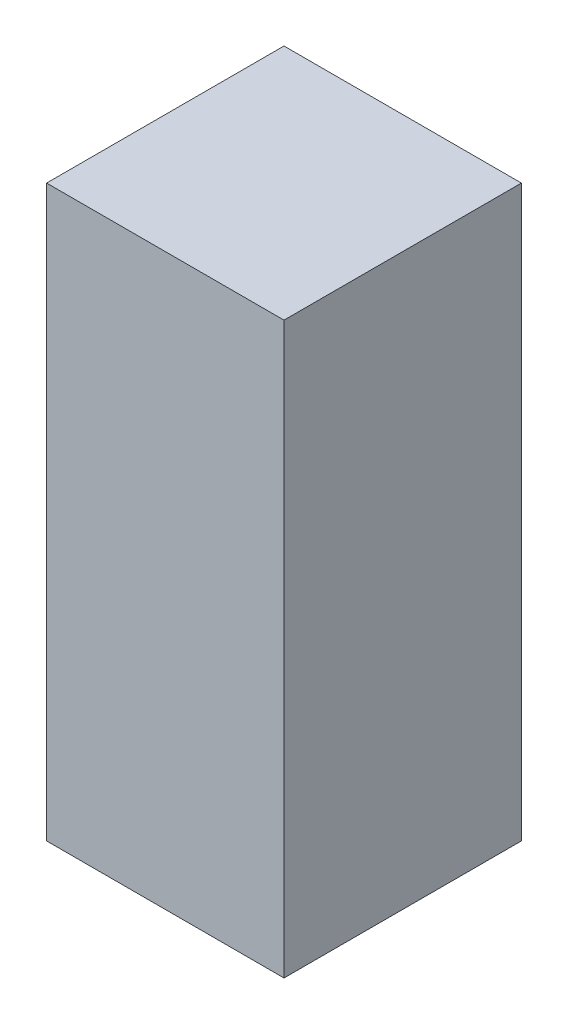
ISO-10303-21;
HEADER;
FILE_DESCRIPTION(('STEP AP214'),'2;1');
FILE_NAME('part.step','',(''),(''),'','','');
FILE_SCHEMA(('AUTOMOTIVE_DESIGN { 1 0 10303 214 1 1 1 1 }'));
ENDSEC;
DATA;
#1=APPLICATION_CONTEXT('core data for automotive mechanical design processes');
#2=APPLICATION_PROTOCOL_DEFINITION('international standard','automotive_design',2000,#1);
#3=PRODUCT_CONTEXT('',#1,'mechanical');
#4=PRODUCT('Part','Part','',(#3));
#5=PRODUCT_RELATED_PRODUCT_CATEGORY('part','',(#4));
#6=PRODUCT_DEFINITION_FORMATION('','',#4);
#7=PRODUCT_DEFINITION_CONTEXT('part definition',#1,'design');
#8=PRODUCT_DEFINITION('design','',#6,#7);
#9=PRODUCT_DEFINITION_SHAPE('','',#8);
#10=(LENGTH_UNIT() NAMED_UNIT(*) SI_UNIT(.MILLI.,.METRE.));
#11=(NAMED_UNIT(*) PLANE_ANGLE_UNIT() SI_UNIT($,.RADIAN.));
#12=(NAMED_UNIT(*) SI_UNIT($,.STERADIAN.) SOLID_ANGLE_UNIT());
#13=UNCERTAINTY_MEASURE_WITH_UNIT(LENGTH_MEASURE(1.E-05),#10,'distance_accuracy_value','');
#14=(GEOMETRIC_REPRESENTATION_CONTEXT(3) GLOBAL_UNCERTAINTY_ASSIGNED_CONTEXT((#13)) GLOBAL_UNIT_ASSIGNED_CONTEXT((#10,
#11,#12)) REPRESENTATION_CONTEXT('',''));
#15=CARTESIAN_POINT('',(0.,0.,0.));
#16=DIRECTION('',(0.,0.,1.));
#17=DIRECTION('',(1.,0.,0.));
#18=AXIS2_PLACEMENT_3D('',#15,#16,#17);
#19=CARTESIAN_POINT('',(-25.,120.,-25.));
#20=DIRECTION('',(1.,0.,0.));
#21=DIRECTION('',(0.,0.,-1.));
#22=AXIS2_PLACEMENT_3D('',#19,#20,#21);
#23=PLANE('',#22);
#24=DIRECTION('',(0.,0.,1.));
#25=VECTOR('',#24,1.);
#26=CARTESIAN_POINT('',(-25.,0.,-25.));
#27=LINE('',#26,#25);
#28=CARTESIAN_POINT('',(-25.,0.,-25.));
#29=VERTEX_POINT('',#28);
#30=CARTESIAN_POINT('',(-25.,0.,25.));
#31=VERTEX_POINT('',#30);
#32=EDGE_CURVE('E94',#29,#31,#27,.T.);
#33=ORIENTED_EDGE('',*,*,#32,.T.);
#34=DIRECTION('',(0.,-1.,0.));
#35=VECTOR('',#34,1.);
#36=CARTESIAN_POINT('',(-25.,120.,25.));
#37=LINE('',#36,#35);
#38=CARTESIAN_POINT('',(-25.,120.,25.));
#39=VERTEX_POINT('',#38);
#40=EDGE_CURVE('E11',#39,#31,#37,.T.);
#41=ORIENTED_EDGE('',*,*,#40,.F.);
#42=DIRECTION('',(0.,0.,1.));
#43=VECTOR('',#42,1.);
#44=CARTESIAN_POINT('',(-25.,120.,-25.));
#45=LINE('',#44,#43);
#46=CARTESIAN_POINT('',(-25.,120.,-25.));
#47=VERTEX_POINT('',#46);
#48=EDGE_CURVE('E82',#47,#39,#45,.T.);
#49=ORIENTED_EDGE('',*,*,#48,.F.);
#50=DIRECTION('',(0.,-1.,0.));
#51=VECTOR('',#50,1.);
#52=CARTESIAN_POINT('',(-25.,120.,-25.));
#53=LINE('',#52,#51);
#54=EDGE_CURVE('E90',#47,#29,#53,.T.);
#55=ORIENTED_EDGE('',*,*,#54,.T.);
#56=EDGE_LOOP('',(#33,#41,#49,#55));
#57=FACE_BOUND('',#56,.T.);
#58=ADVANCED_FACE('F31',(#57),#23,.F.);
#59=CARTESIAN_POINT('',(-25.,120.,25.));
#60=DIRECTION('',(0.,0.,-1.));
#61=DIRECTION('',(-1.,0.,0.));
#62=AXIS2_PLACEMENT_3D('',#59,#60,#61);
#63=PLANE('',#62);
#64=DIRECTION('',(1.,0.,0.));
#65=VECTOR('',#64,1.);
#66=CARTESIAN_POINT('',(-25.,0.,25.));
#67=LINE('',#66,#65);
#68=CARTESIAN_POINT('',(25.,0.,25.));
#69=VERTEX_POINT('',#68);
#70=EDGE_CURVE('E86',#31,#69,#67,.T.);
#71=ORIENTED_EDGE('',*,*,#70,.T.);
#72=DIRECTION('',(0.,-1.,0.));
#73=VECTOR('',#72,1.);
#74=CARTESIAN_POINT('',(25.,120.,25.));
#75=LINE('',#74,#73);
#76=CARTESIAN_POINT('',(25.,120.,25.));
#77=VERTEX_POINT('',#76);
#78=EDGE_CURVE('E39',#77,#69,#75,.T.);
#79=ORIENTED_EDGE('',*,*,#78,.F.);
#80=DIRECTION('',(1.,0.,0.));
#81=VECTOR('',#80,1.);
#82=CARTESIAN_POINT('',(-25.,120.,25.));
#83=LINE('',#82,#81);
#84=EDGE_CURVE('E77',#39,#77,#83,.T.);
#85=ORIENTED_EDGE('',*,*,#84,.F.);
#86=ORIENTED_EDGE('',*,*,#40,.T.);
#87=EDGE_LOOP('',(#71,#79,#85,#86));
#88=FACE_BOUND('',#87,.T.);
#89=ADVANCED_FACE('F85',(#88),#63,.F.);
#90=CARTESIAN_POINT('',(25.,120.,-25.));
#91=DIRECTION('',(-1.,0.,0.));
#92=DIRECTION('',(0.,0.,1.));
#93=AXIS2_PLACEMENT_3D('',#90,#91,#92);
#94=PLANE('',#93);
#95=DIRECTION('',(0.,0.,-1.));
#96=VECTOR('',#95,1.);
#97=CARTESIAN_POINT('',(25.,0.,-25.));
#98=LINE('',#97,#96);
#99=CARTESIAN_POINT('',(25.,0.,-25.));
#100=VERTEX_POINT('',#99);
#101=EDGE_CURVE('E64',#69,#100,#98,.T.);
#102=ORIENTED_EDGE('',*,*,#101,.T.);
#103=DIRECTION('',(0.,-1.,0.));
#104=VECTOR('',#103,1.);
#105=CARTESIAN_POINT('',(25.,120.,-25.));
#106=LINE('',#105,#104);
#107=CARTESIAN_POINT('',(25.,120.,-25.));
#108=VERTEX_POINT('',#107);
#109=EDGE_CURVE('E87',#108,#100,#106,.T.);
#110=ORIENTED_EDGE('',*,*,#109,.F.);
#111=DIRECTION('',(0.,0.,-1.));
#112=VECTOR('',#111,1.);
#113=CARTESIAN_POINT('',(25.,120.,-25.));
#114=LINE('',#113,#112);
#115=EDGE_CURVE('E80',#77,#108,#114,.T.);
#116=ORIENTED_EDGE('',*,*,#115,.F.);
#117=ORIENTED_EDGE('',*,*,#78,.T.);
#118=EDGE_LOOP('',(#102,#110,#116,#117));
#119=FACE_BOUND('',#118,.T.);
#120=ADVANCED_FACE('F88',(#119),#94,.F.);
#121=CARTESIAN_POINT('',(-25.,120.,-25.));
#122=DIRECTION('',(0.,0.,1.));
#123=DIRECTION('',(1.,0.,0.));
#124=AXIS2_PLACEMENT_3D('',#121,#122,#123);
#125=PLANE('',#124);
#126=DIRECTION('',(-1.,0.,0.));
#127=VECTOR('',#126,1.);
#128=CARTESIAN_POINT('',(-25.,0.,-25.));
#129=LINE('',#128,#127);
#130=EDGE_CURVE('E70',#100,#29,#129,.T.);
#131=ORIENTED_EDGE('',*,*,#130,.T.);
#132=ORIENTED_EDGE('',*,*,#54,.F.);
#133=DIRECTION('',(-1.,0.,0.));
#134=VECTOR('',#133,1.);
#135=CARTESIAN_POINT('',(-25.,120.,-25.));
#136=LINE('',#135,#134);
#137=EDGE_CURVE('E47',#108,#47,#136,.T.);
#138=ORIENTED_EDGE('',*,*,#137,.F.);
#139=ORIENTED_EDGE('',*,*,#109,.T.);
#140=EDGE_LOOP('',(#131,#132,#138,#139));
#141=FACE_BOUND('',#140,.T.);
#142=ADVANCED_FACE('F101',(#141),#125,.F.);
#143=CARTESIAN_POINT('',(-25.,120.,25.));
#144=DIRECTION('',(0.,1.,0.));
#145=DIRECTION('',(0.,0.,1.));
#146=AXIS2_PLACEMENT_3D('',#143,#144,#145);
#147=PLANE('',#146);
#148=ORIENTED_EDGE('',*,*,#48,.T.);
#149=ORIENTED_EDGE('',*,*,#84,.T.);
#150=ORIENTED_EDGE('',*,*,#115,.T.);
#151=ORIENTED_EDGE('',*,*,#137,.T.);
#152=EDGE_LOOP('',(#148,#149,#150,#151));
#153=FACE_BOUND('',#152,.T.);
#154=ADVANCED_FACE('F78',(#153),#147,.T.);
#155=CARTESIAN_POINT('',(-25.,0.,25.));
#156=DIRECTION('',(0.,1.,0.));
#157=DIRECTION('',(0.,0.,1.));
#158=AXIS2_PLACEMENT_3D('',#155,#156,#157);
#159=PLANE('',#158);
#160=ORIENTED_EDGE('',*,*,#32,.F.);
#161=ORIENTED_EDGE('',*,*,#130,.F.);
#162=ORIENTED_EDGE('',*,*,#101,.F.);
#163=ORIENTED_EDGE('',*,*,#70,.F.);
#164=EDGE_LOOP('',(#160,#161,#162,#163));
#165=FACE_BOUND('',#164,.T.);
#166=ADVANCED_FACE('F104',(#165),#159,.F.);
#167=CLOSED_SHELL('',(#58,#89,#120,#142,#154,#166));
#168=MANIFOLD_SOLID_BREP('B2',#167);
#169=ADVANCED_BREP_SHAPE_REPRESENTATION('',(#18,#168),#14);
#170=SHAPE_DEFINITION_REPRESENTATION(#9,#169);
ENDSEC;
END-ISO-10303-21;
